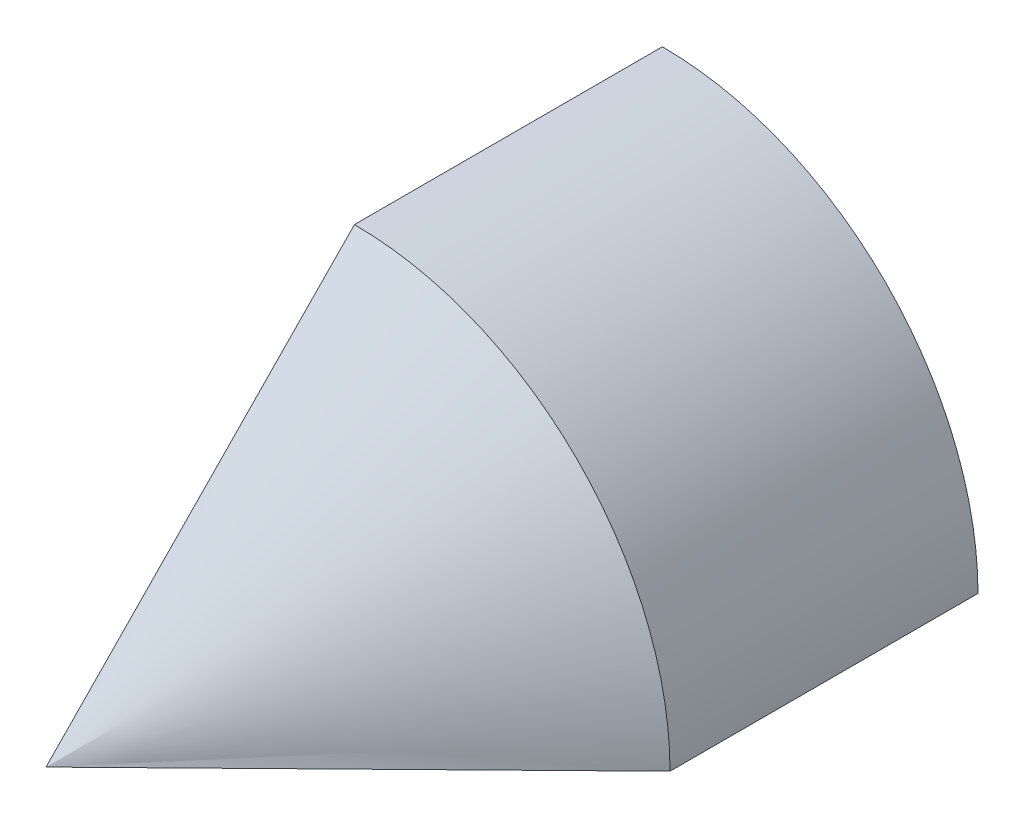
ISO-10303-21;
HEADER;
FILE_DESCRIPTION(('STEP AP214'),'2;1');
FILE_NAME('part.step','',(''),(''),'','','');
FILE_SCHEMA(('AUTOMOTIVE_DESIGN { 1 0 10303 214 1 1 1 1 }'));
ENDSEC;
DATA;
#1=APPLICATION_CONTEXT('core data for automotive mechanical design processes');
#2=APPLICATION_PROTOCOL_DEFINITION('international standard','automotive_design',2000,#1);
#3=PRODUCT_CONTEXT('',#1,'mechanical');
#4=PRODUCT('Part','Part','',(#3));
#5=PRODUCT_RELATED_PRODUCT_CATEGORY('part','',(#4));
#6=PRODUCT_DEFINITION_FORMATION('','',#4);
#7=PRODUCT_DEFINITION_CONTEXT('part definition',#1,'design');
#8=PRODUCT_DEFINITION('design','',#6,#7);
#9=PRODUCT_DEFINITION_SHAPE('','',#8);
#10=(LENGTH_UNIT() NAMED_UNIT(*) SI_UNIT(.MILLI.,.METRE.));
#11=(NAMED_UNIT(*) PLANE_ANGLE_UNIT() SI_UNIT($,.RADIAN.));
#12=(NAMED_UNIT(*) SI_UNIT($,.STERADIAN.) SOLID_ANGLE_UNIT());
#13=UNCERTAINTY_MEASURE_WITH_UNIT(LENGTH_MEASURE(1.E-05),#10,'distance_accuracy_value','');
#14=(GEOMETRIC_REPRESENTATION_CONTEXT(3) GLOBAL_UNCERTAINTY_ASSIGNED_CONTEXT((#13)) GLOBAL_UNIT_ASSIGNED_CONTEXT((#10,
#11,#12)) REPRESENTATION_CONTEXT('',''));
#15=CARTESIAN_POINT('',(0.,0.,0.));
#16=DIRECTION('',(0.,0.,1.));
#17=DIRECTION('',(1.,0.,0.));
#18=AXIS2_PLACEMENT_3D('',#15,#16,#17);
#19=CARTESIAN_POINT('',(0.,0.,-0.8317672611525));
#20=DIRECTION('',(0.,0.,-1.));
#21=DIRECTION('',(-1.,0.,0.));
#22=AXIS2_PLACEMENT_3D('',#19,#20,#21);
#23=CONICAL_SURFACE('',#22,40.9612369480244,0.796944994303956);
#24=CARTESIAN_POINT('',(0.,0.,-0.8317672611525));
#25=DIRECTION('',(0.,0.,1.));
#26=DIRECTION('',(1.,0.,0.));
#27=AXIS2_PLACEMENT_3D('',#24,#25,#26);
#28=CIRCLE('',#27,40.9612369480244);
#29=CARTESIAN_POINT('',(40.9612369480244,-1.43015394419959E-13,-0.8317672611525));
#30=VERTEX_POINT('',#29);
#31=CARTESIAN_POINT('',(0.,40.9612369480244,-0.8317672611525));
#32=VERTEX_POINT('',#31);
#33=EDGE_CURVE('E11',#30,#32,#28,.T.);
#34=ORIENTED_EDGE('',*,*,#33,.T.);
#35=DIRECTION('',(0.,-0.715224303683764,0.698894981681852));
#36=VECTOR('',#35,1.);
#37=CARTESIAN_POINT('',(0.,0.,39.1942816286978));
#38=LINE('',#37,#36);
#39=CARTESIAN_POINT('',(0.,0.,39.1942816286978));
#40=VERTEX_POINT('',#39);
#41=EDGE_CURVE('E44',#32,#40,#38,.T.);
#42=ORIENTED_EDGE('',*,*,#41,.T.);
#43=DIRECTION('',(-0.715224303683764,0.,0.698894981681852));
#44=VECTOR('',#43,1.);
#45=CARTESIAN_POINT('',(0.,0.,39.1942816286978));
#46=LINE('',#45,#44);
#47=EDGE_CURVE('E70',#30,#40,#46,.T.);
#48=ORIENTED_EDGE('',*,*,#47,.F.);
#49=EDGE_LOOP('',(#34,#42,#48));
#50=FACE_BOUND('',#49,.T.);
#51=ADVANCED_FACE('F31',(#50),#23,.T.);
#52=CARTESIAN_POINT('',(0.,0.,51.0810719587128));
#53=DIRECTION('',(0.,0.,1.));
#54=DIRECTION('',(1.,0.,0.));
#55=AXIS2_PLACEMENT_3D('',#52,#53,#54);
#56=CYLINDRICAL_SURFACE('',#55,40.9612369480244);
#57=CARTESIAN_POINT('',(0.,0.,-40.8006046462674));
#58=DIRECTION('',(0.,0.,1.));
#59=DIRECTION('',(1.,0.,0.));
#60=AXIS2_PLACEMENT_3D('',#57,#58,#59);
#61=CIRCLE('',#60,40.9612369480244);
#62=CARTESIAN_POINT('',(40.9612369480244,-1.43015394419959E-13,-40.8006046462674));
#63=VERTEX_POINT('',#62);
#64=CARTESIAN_POINT('',(0.,40.9612369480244,-40.8006046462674));
#65=VERTEX_POINT('',#64);
#66=EDGE_CURVE('E38',#63,#65,#61,.T.);
#67=ORIENTED_EDGE('',*,*,#66,.T.);
#68=DIRECTION('',(0.,0.,1.));
#69=VECTOR('',#68,1.);
#70=CARTESIAN_POINT('',(0.,40.9612369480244,-0.8317672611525));
#71=LINE('',#70,#69);
#72=EDGE_CURVE('E65',#65,#32,#71,.T.);
#73=ORIENTED_EDGE('',*,*,#72,.T.);
#74=ORIENTED_EDGE('',*,*,#33,.F.);
#75=DIRECTION('',(0.,0.,1.));
#76=VECTOR('',#75,1.);
#77=CARTESIAN_POINT('',(40.9612369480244,-1.43015394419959E-13,-0.8317672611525));
#78=LINE('',#77,#76);
#79=EDGE_CURVE('E66',#63,#30,#78,.T.);
#80=ORIENTED_EDGE('',*,*,#79,.F.);
#81=EDGE_LOOP('',(#67,#73,#74,#80));
#82=FACE_BOUND('',#81,.T.);
#83=ADVANCED_FACE('F63',(#82),#56,.T.);
#84=CARTESIAN_POINT('',(40.9612369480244,-1.43015394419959E-13,-40.8006046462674));
#85=DIRECTION('',(0.,0.,1.));
#86=DIRECTION('',(1.,0.,0.));
#87=AXIS2_PLACEMENT_3D('',#84,#85,#86);
#88=PLANE('',#87);
#89=DIRECTION('',(1.,0.,0.));
#90=VECTOR('',#89,1.);
#91=CARTESIAN_POINT('',(40.9612369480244,-1.43015394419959E-13,-40.8006046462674));
#92=LINE('',#91,#90);
#93=CARTESIAN_POINT('',(0.,0.,-40.8006046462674));
#94=VERTEX_POINT('',#93);
#95=EDGE_CURVE('E74',#94,#63,#92,.T.);
#96=ORIENTED_EDGE('',*,*,#95,.F.);
#97=DIRECTION('',(0.,1.,0.));
#98=VECTOR('',#97,1.);
#99=CARTESIAN_POINT('',(0.,40.9612369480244,-40.8006046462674));
#100=LINE('',#99,#98);
#101=EDGE_CURVE('E72',#94,#65,#100,.T.);
#102=ORIENTED_EDGE('',*,*,#101,.T.);
#103=ORIENTED_EDGE('',*,*,#66,.F.);
#104=EDGE_LOOP('',(#96,#102,#103));
#105=FACE_BOUND('',#104,.T.);
#106=ADVANCED_FACE('F73',(#105),#88,.F.);
#107=CARTESIAN_POINT('',(0.,0.,-40.8006046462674));
#108=DIRECTION('',(0.,1.,0.));
#109=DIRECTION('',(0.,0.,1.));
#110=AXIS2_PLACEMENT_3D('',#107,#108,#109);
#111=PLANE('',#110);
#112=DIRECTION('',(0.,0.,-1.));
#113=VECTOR('',#112,1.);
#114=CARTESIAN_POINT('',(0.,0.,39.1942816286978));
#115=LINE('',#114,#113);
#116=EDGE_CURVE('E80',#40,#94,#115,.T.);
#117=ORIENTED_EDGE('',*,*,#116,.T.);
#118=ORIENTED_EDGE('',*,*,#95,.T.);
#119=ORIENTED_EDGE('',*,*,#79,.T.);
#120=ORIENTED_EDGE('',*,*,#47,.T.);
#121=EDGE_LOOP('',(#117,#118,#119,#120));
#122=FACE_BOUND('',#121,.T.);
#123=ADVANCED_FACE('F87',(#122),#111,.F.);
#124=CARTESIAN_POINT('',(0.,0.,-40.8006046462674));
#125=DIRECTION('',(-1.,0.,0.));
#126=DIRECTION('',(0.,0.,1.));
#127=AXIS2_PLACEMENT_3D('',#124,#125,#126);
#128=PLANE('',#127);
#129=ORIENTED_EDGE('',*,*,#116,.F.);
#130=ORIENTED_EDGE('',*,*,#41,.F.);
#131=ORIENTED_EDGE('',*,*,#72,.F.);
#132=ORIENTED_EDGE('',*,*,#101,.F.);
#133=EDGE_LOOP('',(#129,#130,#131,#132));
#134=FACE_BOUND('',#133,.T.);
#135=ADVANCED_FACE('F78',(#134),#128,.T.);
#136=CLOSED_SHELL('',(#51,#83,#106,#123,#135));
#137=MANIFOLD_SOLID_BREP('B2',#136);
#138=ADVANCED_BREP_SHAPE_REPRESENTATION('',(#18,#137),#14);
#139=SHAPE_DEFINITION_REPRESENTATION(#9,#138);
ENDSEC;
END-ISO-10303-21;
